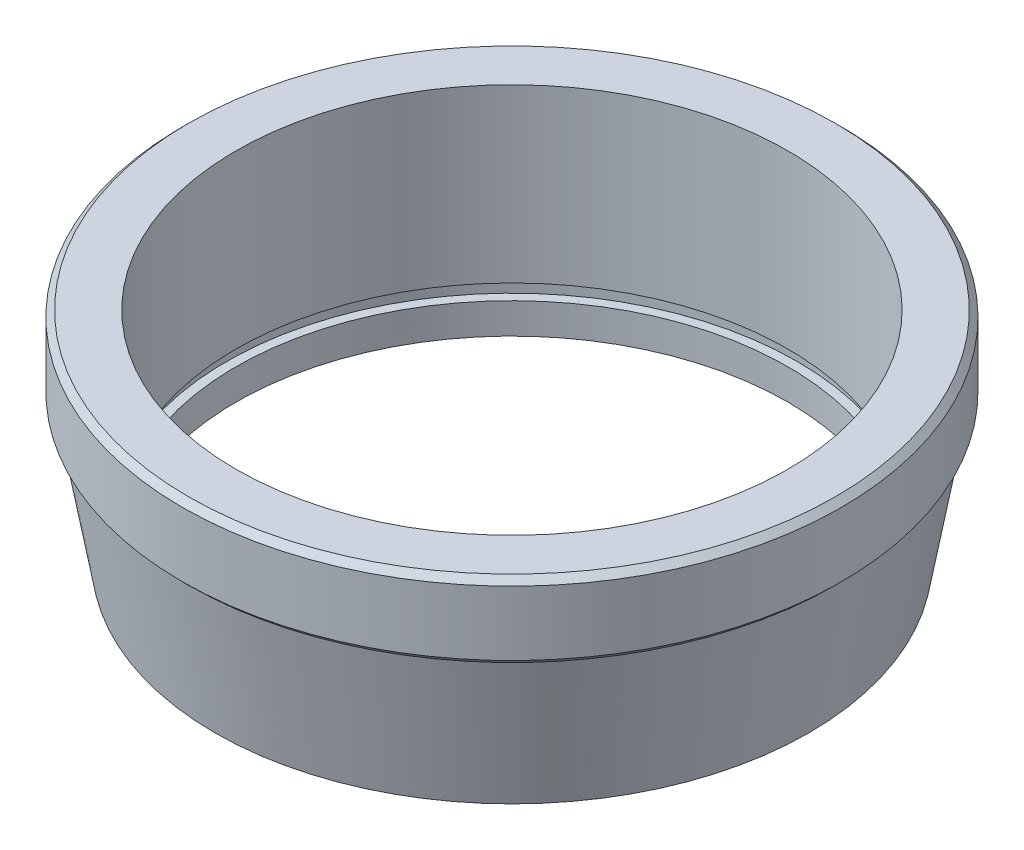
from build123d import *

# Parameters (mm, degrees)
SKICA1_R                 = 10.5
P_IDAT_VYSUNUT_M1_DEPTH  = 4.6
P_IDAT_VYSUNUT_M1_DRAFT  = -10
SKICA2_R                 = 10.75
P_IDAT_VYSUNUT_M2_DEPTH  = 2.5
ZKOSEN_1_SIZE            = 0.2
SKICA3_R                 = 9
ODEBRAT_VYSUNUT_M1_DEPTH = 2.5
ODEBRAT_START            = -4.6
SKICA4_R                 = 9
ODEBRAT_VYSUNUT_M2_DEPTH = 4.6
SKICA5_W                 = 0.3
SKICA5_H                 = 0.5


with BuildPart() as part:
    # Skica1 → P_idat vysunut_m1 (with draft: the straight prism first)
    with BuildSketch(Plane(origin=(0, 0, 0), x_dir=(1, 0, 0), z_dir=(0, 1, 0))):
        Circle(SKICA1_R)
    extrude(amount=-P_IDAT_VYSUNUT_M1_DEPTH)
    # P_idat vysunut_m1: the draft: its side faces are tilted about the plane it starts from
    p_idat_vysunut_m1_sides = [part.faces().sort_by_distance(p)[0] for p in [
        (-10.5, -2.3, 0),
    ]]
    draft(p_idat_vysunut_m1_sides, Plane(origin=(0, 0, 0), x_dir=(1, 0, 0), z_dir=(0, 1, 0)), P_IDAT_VYSUNUT_M1_DRAFT)

    # Skica2 → P_idat vysunut_m2 (add)
    with BuildSketch(Plane(origin=(0, 0, 0), x_dir=(-1, 0, 0), z_dir=(0, 1, 0))):
        with Locations(Location((0, 0, 0), (0, 0, 90))):
            Circle(SKICA2_R)
    extrude(amount=P_IDAT_VYSUNUT_M2_DEPTH)

    # Zkosen_1
    zkosen_1_edges = [part.edges().sort_by_distance(p)[0] for p in [
        (0, 0, -10.75),
        (0, 2.5, -10.75),
    ]]
    chamfer(zkosen_1_edges, length=ZKOSEN_1_SIZE)

    # Skica3 → Odebrat vysunut_m1 (cut)
    with BuildSketch(Plane(origin=(0, 2.5, 0), x_dir=(1, 0, 0), z_dir=(0, 1, 0))):
        with Locations(Location((0, 0, 0), (0, 0, 270))):
            Circle(SKICA3_R)
    extrude(amount=-ODEBRAT_VYSUNUT_M1_DEPTH, mode=Mode.SUBTRACT)

    # Skica4 → Odebrat vysunut_m2 (cut)
    with BuildSketch(Plane.XZ.offset(4.6).offset(ODEBRAT_START)):
        with Locations(Location((0, 0, 0), (0, 0, 90))):
            Circle(SKICA4_R)
    extrude(amount=ODEBRAT_VYSUNUT_M2_DEPTH, mode=Mode.SUBTRACT)

    # Skica5 → Odebrat rotac_1 (revolve, cut)
    with BuildSketch(Plane.XY, mode=Mode.PRIVATE) as odebrat_rotac_1_sk:
        with Locations((-9.15, -3.35)):
            Rectangle(SKICA5_W, SKICA5_H)
    revolve(odebrat_rotac_1_sk.sketch.rotate(Axis((0, 2.5, 0), (0, -1, 0)), 270), axis=Axis((0, 2.5, 0), (0, -1, 0)), mode=Mode.SUBTRACT)


solid = part.part
